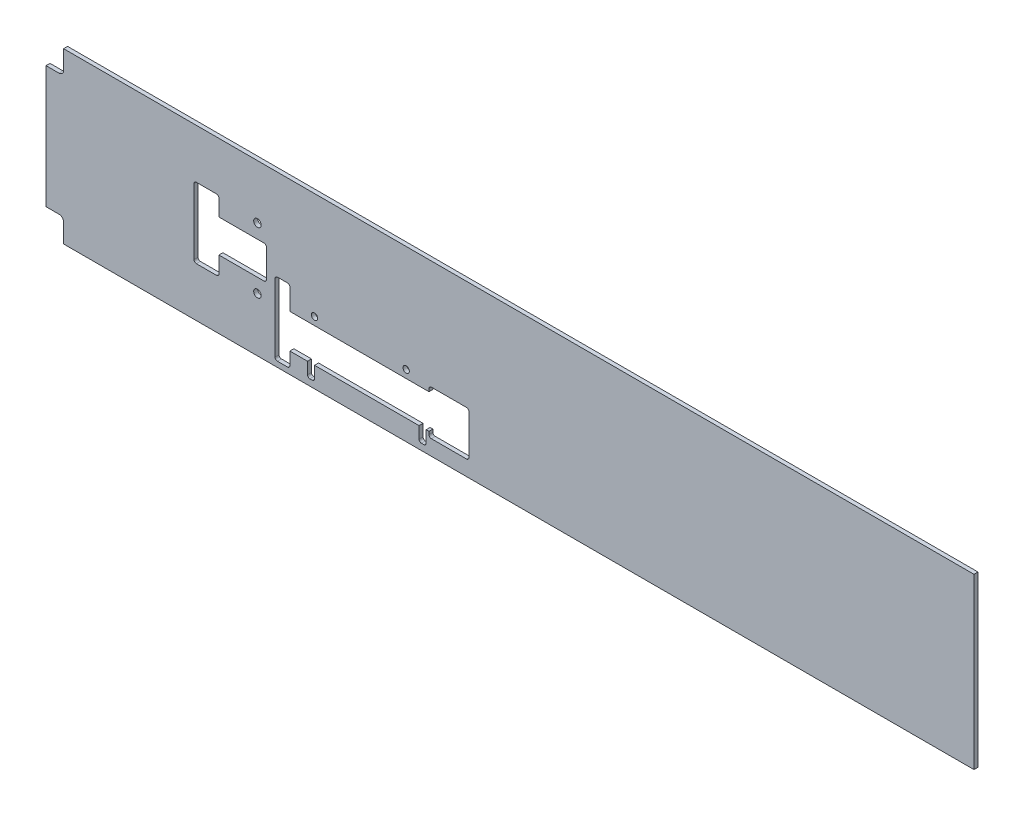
from build123d import *

# Parameters (mm, degrees)
PLAQUE_DEPTH                   = 1.7
LUMI_RE_MOTEUR_DEPTH           = 201.761400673
ESQUISSE3_R                    = 1.6
PER_AGE_FIXATION_PLAQUE_DEPTH  = 201.761400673
LUMI_RE_CAPTEUR_DEPTH          = 201.761400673
ESQUISSE5_R                    = 1.35
PER_AGE_FIXATION_CAPTEUR_DEPTH = 201.761400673


with BuildPart() as part:
    # Esquisse1 → Plaque (new body)
    with BuildSketch(Plane.XY):
        with BuildLine():
            Line((-197.5, 26), (-192, 26))
            ThreePointArc((-192, 26), (-190.585786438, 26.585786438), (-190, 28))
            Line((-190, 28), (-190, 36))
            Line((-190, 36), (197.5, 36))
            Line((197.5, 36), (197.5, -36))
            Line((197.5, -36), (-190, -36))
            Line((-190, -36), (-190, -28))
            ThreePointArc((-190, -28), (-190.585786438, -26.585786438), (-192, -26))
            Line((-192, -26), (-197.5, -26))
            Line((-197.5, -26), (-197.5, 26))
        make_face()
    extrude(amount=PLAQUE_DEPTH)

    # Esquisse2 → Lumi_re moteur (cut, through all)
    with BuildSketch(Plane.XY.offset(1.7)):
        with BuildLine():
            Line((-123.9, -7), (-123.9, -14))
            ThreePointArc((-123.9, -14), (-124.192893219, -14.707106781), (-124.9, -15))
            Line((-124.9, -15), (-133.5, -15))
            ThreePointArc((-133.5, -15), (-134.207106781, -14.707106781), (-134.5, -14))
            Line((-134.5, -14), (-134.5, 14))
            ThreePointArc((-134.5, 14), (-134.207106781, 14.707106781), (-133.5, 15))
            Line((-133.5, 15), (-124.9, 15))
            ThreePointArc((-124.9, 15), (-124.192893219, 14.707106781), (-123.9, 14))
            Line((-123.9, 14), (-123.9, 7))
            Line((-123.9, 7), (-104.7, 7))
            ThreePointArc((-104.7, 7), (-103.992893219, 6.707106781), (-103.7, 6))
            Line((-103.7, 6), (-103.7, -6))
            ThreePointArc((-103.7, -6), (-103.992893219, -6.707106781), (-104.7, -7))
            Line((-104.7, -7), (-123.9, -7))
        make_face()
    extrude(amount=-LUMI_RE_MOTEUR_DEPTH, mode=Mode.SUBTRACT)

    # Esquisse3 → Per_age fixation plaque (cut, through all)
    with BuildSketch(Plane.XY.offset(1.7)):
        with Locations((-107.5, 13)):
            Circle(ESQUISSE3_R)
        with Locations(Location((-107.5, -13, 0), (0, 0, 180))):
            Circle(ESQUISSE3_R)
    extrude(amount=-PER_AGE_FIXATION_PLAQUE_DEPTH, mode=Mode.SUBTRACT)

    # Esquisse4 → Lumi_re capteur (cut, through all)
    with BuildSketch(Plane.XY.offset(1.7)):
        with BuildLine():
            Line((-35.7, -27.3), (-34.5, -27.3))
            Line((-34.5, -27.3), (-34.5, -28.5))
            ThreePointArc((-34.5, -28.5), (-34.207106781, -29.207106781), (-33.5, -29.5))
            Line((-33.5, -29.5), (-18.5, -29.5))
            ThreePointArc((-18.5, -29.5), (-17.792893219, -29.207106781), (-17.5, -28.5))
            Line((-17.5, -28.5), (-17.5, -11.5))
            ThreePointArc((-17.5, -11.5), (-17.792893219, -10.792893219), (-18.5, -10.5))
            Line((-18.5, -10.5), (-33.5, -10.5))
            ThreePointArc((-33.5, -10.5), (-34.207106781, -10.792893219), (-34.5, -11.5))
            Line((-34.5, -11.5), (-34.5, -12.7))
            Line((-34.5, -12.7), (-93.7, -12.7))
            Line((-93.7, -12.7), (-93.7, -3.7))
            ThreePointArc((-93.7, -3.7), (-93.992893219, -2.992893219), (-94.7, -2.7))
            Line((-94.7, -2.7), (-99, -2.7))
            ThreePointArc((-99, -2.7), (-99.707106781, -2.992893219), (-100, -3.7))
            Line((-100, -3.7), (-100, -32.7))
            ThreePointArc((-100, -32.7), (-99.707106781, -33.407106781), (-99, -33.7))
            Line((-99, -33.7), (-94.7, -33.7))
            ThreePointArc((-94.7, -33.7), (-93.992893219, -33.407106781), (-93.7, -32.7))
            Line((-93.7, -32.7), (-93.7, -27.3))
            Line((-93.7, -27.3), (-86.2, -27.3))
            Line((-86.2, -27.3), (-86.2, -32.3))
            ThreePointArc((-86.2, -32.3), (-85.907106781, -33.007106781), (-85.2, -33.3))
            Line((-85.2, -33.3), (-84.2, -33.3))
            ThreePointArc((-84.2, -33.3), (-83.492893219, -33.007106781), (-83.2, -32.3))
            Line((-83.2, -32.3), (-83.2, -27.3))
            Line((-83.2, -27.3), (-38.7, -27.3))
            Line((-38.7, -27.3), (-38.7, -32.3))
            ThreePointArc((-38.7, -32.3), (-38.407106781, -33.007106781), (-37.7, -33.3))
            Line((-37.7, -33.3), (-36.7, -33.3))
            ThreePointArc((-36.7, -33.3), (-35.992893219, -33.007106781), (-35.7, -32.3))
            Line((-35.7, -32.3), (-35.7, -27.3))
        make_face()
    extrude(amount=-LUMI_RE_CAPTEUR_DEPTH, mode=Mode.SUBTRACT)

    # Esquisse5 → per_age fixation capteur (cut, through all)
    with BuildSketch(Plane.XY.offset(1.7)):
        with Locations((-44.2, -9.35)):
            Circle(ESQUISSE5_R)
        with Locations((-83.2, -9.35)):
            Circle(ESQUISSE5_R)
    extrude(amount=-PER_AGE_FIXATION_CAPTEUR_DEPTH, mode=Mode.SUBTRACT)


solid = part.part
